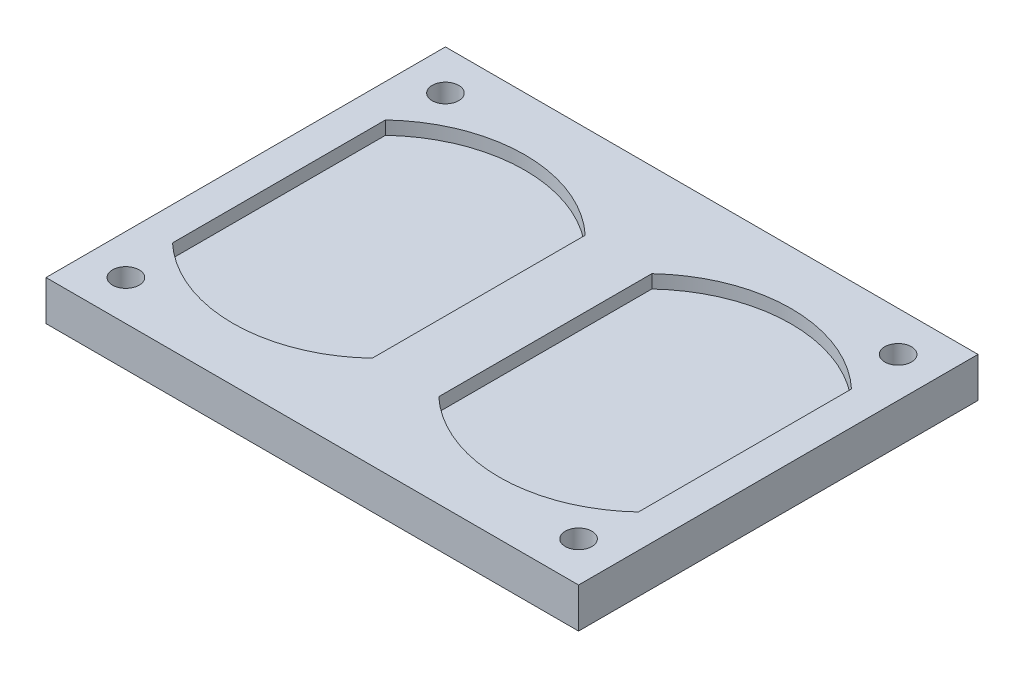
ISO-10303-21;
HEADER;
FILE_DESCRIPTION(('STEP AP214'),'2;1');
FILE_NAME('part.step','',(''),(''),'','','');
FILE_SCHEMA(('AUTOMOTIVE_DESIGN { 1 0 10303 214 1 1 1 1 }'));
ENDSEC;
DATA;
#1=APPLICATION_CONTEXT('core data for automotive mechanical design processes');
#2=APPLICATION_PROTOCOL_DEFINITION('international standard','automotive_design',2000,#1);
#3=PRODUCT_CONTEXT('',#1,'mechanical');
#4=PRODUCT('Part','Part','',(#3));
#5=PRODUCT_RELATED_PRODUCT_CATEGORY('part','',(#4));
#6=PRODUCT_DEFINITION_FORMATION('','',#4);
#7=PRODUCT_DEFINITION_CONTEXT('part definition',#1,'design');
#8=PRODUCT_DEFINITION('design','',#6,#7);
#9=PRODUCT_DEFINITION_SHAPE('','',#8);
#10=(LENGTH_UNIT() NAMED_UNIT(*) SI_UNIT(.MILLI.,.METRE.));
#11=(NAMED_UNIT(*) PLANE_ANGLE_UNIT() SI_UNIT($,.RADIAN.));
#12=(NAMED_UNIT(*) SI_UNIT($,.STERADIAN.) SOLID_ANGLE_UNIT());
#13=UNCERTAINTY_MEASURE_WITH_UNIT(LENGTH_MEASURE(1.E-05),#10,'distance_accuracy_value','');
#14=(GEOMETRIC_REPRESENTATION_CONTEXT(3) GLOBAL_UNCERTAINTY_ASSIGNED_CONTEXT((#13)) GLOBAL_UNIT_ASSIGNED_CONTEXT((#10,
#11,#12)) REPRESENTATION_CONTEXT('',''));
#15=CARTESIAN_POINT('',(0.,0.,0.));
#16=DIRECTION('',(0.,0.,1.));
#17=DIRECTION('',(1.,0.,0.));
#18=AXIS2_PLACEMENT_3D('',#15,#16,#17);
#19=CARTESIAN_POINT('',(0.,0.,0.));
#20=DIRECTION('',(0.,-1.,0.));
#21=DIRECTION('',(0.,0.,-1.));
#22=AXIS2_PLACEMENT_3D('',#19,#20,#21);
#23=PLANE('',#22);
#24=CARTESIAN_POINT('',(-85.,0.,60.));
#25=DIRECTION('',(0.,1.,0.));
#26=DIRECTION('',(0.,0.,1.));
#27=AXIS2_PLACEMENT_3D('',#24,#25,#26);
#28=CIRCLE('',#27,5.);
#29=CARTESIAN_POINT('',(-85.,0.,65.));
#30=VERTEX_POINT('',#29);
#31=EDGE_CURVE('E149',#30,#30,#28,.T.);
#32=ORIENTED_EDGE('',*,*,#31,.T.);
#33=EDGE_LOOP('',(#32));
#34=FACE_BOUND('',#33,.T.);
#35=DIRECTION('',(0.,0.,-1.));
#36=VECTOR('',#35,1.);
#37=CARTESIAN_POINT('',(100.,0.,75.));
#38=LINE('',#37,#36);
#39=CARTESIAN_POINT('',(100.,0.,75.));
#40=VERTEX_POINT('',#39);
#41=CARTESIAN_POINT('',(100.,0.,-75.));
#42=VERTEX_POINT('',#41);
#43=EDGE_CURVE('E162',#40,#42,#38,.T.);
#44=ORIENTED_EDGE('',*,*,#43,.F.);
#45=DIRECTION('',(1.,0.,0.));
#46=VECTOR('',#45,1.);
#47=CARTESIAN_POINT('',(-100.,0.,75.));
#48=LINE('',#47,#46);
#49=CARTESIAN_POINT('',(-100.,0.,75.));
#50=VERTEX_POINT('',#49);
#51=EDGE_CURVE('E199',#50,#40,#48,.T.);
#52=ORIENTED_EDGE('',*,*,#51,.F.);
#53=DIRECTION('',(0.,0.,1.));
#54=VECTOR('',#53,1.);
#55=CARTESIAN_POINT('',(-100.,0.,75.));
#56=LINE('',#55,#54);
#57=CARTESIAN_POINT('',(-100.,0.,-75.));
#58=VERTEX_POINT('',#57);
#59=EDGE_CURVE('E210',#58,#50,#56,.T.);
#60=ORIENTED_EDGE('',*,*,#59,.F.);
#61=DIRECTION('',(-1.,0.,0.));
#62=VECTOR('',#61,1.);
#63=CARTESIAN_POINT('',(-100.,0.,-75.));
#64=LINE('',#63,#62);
#65=EDGE_CURVE('E208',#42,#58,#64,.T.);
#66=ORIENTED_EDGE('',*,*,#65,.F.);
#67=EDGE_LOOP('',(#44,#52,#60,#66));
#68=FACE_BOUND('',#67,.T.);
#69=CARTESIAN_POINT('',(85.,0.,60.));
#70=DIRECTION('',(0.,1.,0.));
#71=DIRECTION('',(0.,0.,1.));
#72=AXIS2_PLACEMENT_3D('',#69,#70,#71);
#73=CIRCLE('',#72,5.);
#74=CARTESIAN_POINT('',(85.,0.,65.));
#75=VERTEX_POINT('',#74);
#76=EDGE_CURVE('E331',#75,#75,#73,.T.);
#77=ORIENTED_EDGE('',*,*,#76,.T.);
#78=EDGE_LOOP('',(#77));
#79=FACE_BOUND('',#78,.T.);
#80=CARTESIAN_POINT('',(85.,0.,-60.));
#81=DIRECTION('',(0.,1.,0.));
#82=DIRECTION('',(0.,0.,1.));
#83=AXIS2_PLACEMENT_3D('',#80,#81,#82);
#84=CIRCLE('',#83,5.);
#85=CARTESIAN_POINT('',(85.,0.,-55.));
#86=VERTEX_POINT('',#85);
#87=EDGE_CURVE('E325',#86,#86,#84,.T.);
#88=ORIENTED_EDGE('',*,*,#87,.T.);
#89=EDGE_LOOP('',(#88));
#90=FACE_BOUND('',#89,.T.);
#91=CARTESIAN_POINT('',(-85.,0.,-60.));
#92=DIRECTION('',(0.,1.,0.));
#93=DIRECTION('',(0.,0.,1.));
#94=AXIS2_PLACEMENT_3D('',#91,#92,#93);
#95=CIRCLE('',#94,5.);
#96=CARTESIAN_POINT('',(-85.,0.,-55.));
#97=VERTEX_POINT('',#96);
#98=EDGE_CURVE('E315',#97,#97,#95,.T.);
#99=ORIENTED_EDGE('',*,*,#98,.T.);
#100=EDGE_LOOP('',(#99));
#101=FACE_BOUND('',#100,.T.);
#102=ADVANCED_FACE('F34',(#34,#68,#79,#90,#101),#23,.T.);
#103=CARTESIAN_POINT('',(0.,15.,0.));
#104=DIRECTION('',(0.,-1.,0.));
#105=DIRECTION('',(0.,0.,-1.));
#106=AXIS2_PLACEMENT_3D('',#103,#104,#105);
#107=PLANE('',#106);
#108=CARTESIAN_POINT('',(-85.,15.,-60.));
#109=DIRECTION('',(0.,1.,0.));
#110=DIRECTION('',(0.,0.,1.));
#111=AXIS2_PLACEMENT_3D('',#108,#109,#110);
#112=CIRCLE('',#111,5.);
#113=CARTESIAN_POINT('',(-85.,15.,-55.));
#114=VERTEX_POINT('',#113);
#115=EDGE_CURVE('E318',#114,#114,#112,.T.);
#116=ORIENTED_EDGE('',*,*,#115,.F.);
#117=EDGE_LOOP('',(#116));
#118=FACE_BOUND('',#117,.T.);
#119=CARTESIAN_POINT('',(85.,15.,-60.));
#120=DIRECTION('',(0.,1.,0.));
#121=DIRECTION('',(0.,0.,1.));
#122=AXIS2_PLACEMENT_3D('',#119,#120,#121);
#123=CIRCLE('',#122,5.);
#124=CARTESIAN_POINT('',(85.,15.,-55.));
#125=VERTEX_POINT('',#124);
#126=EDGE_CURVE('E320',#125,#125,#123,.T.);
#127=ORIENTED_EDGE('',*,*,#126,.F.);
#128=EDGE_LOOP('',(#127));
#129=FACE_BOUND('',#128,.T.);
#130=CARTESIAN_POINT('',(85.,15.,60.));
#131=DIRECTION('',(0.,1.,0.));
#132=DIRECTION('',(0.,0.,1.));
#133=AXIS2_PLACEMENT_3D('',#130,#131,#132);
#134=CIRCLE('',#133,5.);
#135=CARTESIAN_POINT('',(85.,15.,65.));
#136=VERTEX_POINT('',#135);
#137=EDGE_CURVE('E328',#136,#136,#134,.T.);
#138=ORIENTED_EDGE('',*,*,#137,.F.);
#139=EDGE_LOOP('',(#138));
#140=FACE_BOUND('',#139,.T.);
#141=DIRECTION('',(0.,0.,1.));
#142=VECTOR('',#141,1.);
#143=CARTESIAN_POINT('',(-87.5,15.,40.0000000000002));
#144=LINE('',#143,#142);
#145=CARTESIAN_POINT('',(-87.5,15.,-39.9999999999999));
#146=VERTEX_POINT('',#145);
#147=CARTESIAN_POINT('',(-87.4999999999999,15.,40.0000000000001));
#148=VERTEX_POINT('',#147);
#149=EDGE_CURVE('E155',#146,#148,#144,.T.);
#150=ORIENTED_EDGE('',*,*,#149,.F.);
#151=CARTESIAN_POINT('',(-50.,15.,0.));
#152=DIRECTION('',(0.,1.,0.));
#153=DIRECTION('',(0.,0.,-1.));
#154=AXIS2_PLACEMENT_3D('',#151,#152,#153);
#155=CIRCLE('',#154,54.8292804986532);
#156=CARTESIAN_POINT('',(-12.5,15.,-39.9999999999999));
#157=VERTEX_POINT('',#156);
#158=EDGE_CURVE('E49',#157,#146,#155,.T.);
#159=ORIENTED_EDGE('',*,*,#158,.F.);
#160=DIRECTION('',(0.,0.,-1.));
#161=VECTOR('',#160,1.);
#162=CARTESIAN_POINT('',(-12.5,15.,39.9999999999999));
#163=LINE('',#162,#161);
#164=CARTESIAN_POINT('',(-12.5,15.,39.9999999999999));
#165=VERTEX_POINT('',#164);
#166=EDGE_CURVE('E143',#165,#157,#163,.T.);
#167=ORIENTED_EDGE('',*,*,#166,.F.);
#168=CARTESIAN_POINT('',(-50.,15.,0.));
#169=DIRECTION('',(0.,1.,0.));
#170=DIRECTION('',(0.,0.,-1.));
#171=AXIS2_PLACEMENT_3D('',#168,#169,#170);
#172=CIRCLE('',#171,54.8292804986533);
#173=EDGE_CURVE('E146',#148,#165,#172,.T.);
#174=ORIENTED_EDGE('',*,*,#173,.F.);
#175=EDGE_LOOP('',(#150,#159,#167,#174));
#176=FACE_BOUND('',#175,.T.);
#177=DIRECTION('',(0.,0.,-1.));
#178=VECTOR('',#177,1.);
#179=CARTESIAN_POINT('',(87.5000000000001,15.,40.0000000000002));
#180=LINE('',#179,#178);
#181=CARTESIAN_POINT('',(87.5000000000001,15.,40.0000000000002));
#182=VERTEX_POINT('',#181);
#183=CARTESIAN_POINT('',(87.5000000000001,15.,-39.9999999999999));
#184=VERTEX_POINT('',#183);
#185=EDGE_CURVE('E181',#182,#184,#180,.T.);
#186=ORIENTED_EDGE('',*,*,#185,.F.);
#187=CARTESIAN_POINT('',(50.,15.,0.));
#188=DIRECTION('',(0.,1.,0.));
#189=DIRECTION('',(0.,0.,1.));
#190=AXIS2_PLACEMENT_3D('',#187,#188,#189);
#191=CIRCLE('',#190,54.8292804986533);
#192=CARTESIAN_POINT('',(12.5,15.,39.9999999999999));
#193=VERTEX_POINT('',#192);
#194=EDGE_CURVE('E57',#193,#182,#191,.T.);
#195=ORIENTED_EDGE('',*,*,#194,.F.);
#196=DIRECTION('',(0.,0.,1.));
#197=VECTOR('',#196,1.);
#198=CARTESIAN_POINT('',(12.5,15.,39.9999999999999));
#199=LINE('',#198,#197);
#200=CARTESIAN_POINT('',(12.5,15.,-39.9999999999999));
#201=VERTEX_POINT('',#200);
#202=EDGE_CURVE('E170',#201,#193,#199,.T.);
#203=ORIENTED_EDGE('',*,*,#202,.F.);
#204=CARTESIAN_POINT('',(50.,15.,0.));
#205=DIRECTION('',(0.,1.,0.));
#206=DIRECTION('',(0.,0.,1.));
#207=AXIS2_PLACEMENT_3D('',#204,#205,#206);
#208=CIRCLE('',#207,54.8292804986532);
#209=EDGE_CURVE('E184',#184,#201,#208,.T.);
#210=ORIENTED_EDGE('',*,*,#209,.F.);
#211=EDGE_LOOP('',(#186,#195,#203,#210));
#212=FACE_BOUND('',#211,.T.);
#213=DIRECTION('',(0.,0.,-1.));
#214=VECTOR('',#213,1.);
#215=CARTESIAN_POINT('',(100.,15.,75.));
#216=LINE('',#215,#214);
#217=CARTESIAN_POINT('',(100.,15.,75.));
#218=VERTEX_POINT('',#217);
#219=CARTESIAN_POINT('',(100.,15.,-75.));
#220=VERTEX_POINT('',#219);
#221=EDGE_CURVE('E195',#218,#220,#216,.T.);
#222=ORIENTED_EDGE('',*,*,#221,.T.);
#223=DIRECTION('',(-1.,0.,0.));
#224=VECTOR('',#223,1.);
#225=CARTESIAN_POINT('',(-100.,15.,-75.));
#226=LINE('',#225,#224);
#227=CARTESIAN_POINT('',(-100.,15.,-75.));
#228=VERTEX_POINT('',#227);
#229=EDGE_CURVE('E198',#220,#228,#226,.T.);
#230=ORIENTED_EDGE('',*,*,#229,.T.);
#231=DIRECTION('',(0.,0.,1.));
#232=VECTOR('',#231,1.);
#233=CARTESIAN_POINT('',(-100.,15.,75.));
#234=LINE('',#233,#232);
#235=CARTESIAN_POINT('',(-100.,15.,75.));
#236=VERTEX_POINT('',#235);
#237=EDGE_CURVE('E201',#228,#236,#234,.T.);
#238=ORIENTED_EDGE('',*,*,#237,.T.);
#239=DIRECTION('',(1.,0.,0.));
#240=VECTOR('',#239,1.);
#241=CARTESIAN_POINT('',(-100.,15.,75.));
#242=LINE('',#241,#240);
#243=EDGE_CURVE('E203',#236,#218,#242,.T.);
#244=ORIENTED_EDGE('',*,*,#243,.T.);
#245=EDGE_LOOP('',(#222,#230,#238,#244));
#246=FACE_BOUND('',#245,.T.);
#247=CARTESIAN_POINT('',(-85.,15.,60.));
#248=DIRECTION('',(0.,1.,0.));
#249=DIRECTION('',(0.,0.,1.));
#250=AXIS2_PLACEMENT_3D('',#247,#248,#249);
#251=CIRCLE('',#250,5.);
#252=CARTESIAN_POINT('',(-85.,15.,65.));
#253=VERTEX_POINT('',#252);
#254=EDGE_CURVE('E333',#253,#253,#251,.T.);
#255=ORIENTED_EDGE('',*,*,#254,.F.);
#256=EDGE_LOOP('',(#255));
#257=FACE_BOUND('',#256,.T.);
#258=ADVANCED_FACE('F237',(#118,#129,#140,#176,#212,#246,#257),#107,.F.);
#259=CARTESIAN_POINT('',(100.,15.,75.));
#260=DIRECTION('',(-1.,0.,0.));
#261=DIRECTION('',(0.,0.,1.));
#262=AXIS2_PLACEMENT_3D('',#259,#260,#261);
#263=PLANE('',#262);
#264=ORIENTED_EDGE('',*,*,#43,.T.);
#265=DIRECTION('',(0.,-1.,0.));
#266=VECTOR('',#265,1.);
#267=CARTESIAN_POINT('',(100.,15.,-75.));
#268=LINE('',#267,#266);
#269=EDGE_CURVE('E11',#220,#42,#268,.T.);
#270=ORIENTED_EDGE('',*,*,#269,.F.);
#271=ORIENTED_EDGE('',*,*,#221,.F.);
#272=DIRECTION('',(0.,-1.,0.));
#273=VECTOR('',#272,1.);
#274=CARTESIAN_POINT('',(100.,15.,75.));
#275=LINE('',#274,#273);
#276=EDGE_CURVE('E205',#218,#40,#275,.T.);
#277=ORIENTED_EDGE('',*,*,#276,.T.);
#278=EDGE_LOOP('',(#264,#270,#271,#277));
#279=FACE_BOUND('',#278,.T.);
#280=ADVANCED_FACE('F36',(#279),#263,.F.);
#281=CARTESIAN_POINT('',(-100.,15.,-75.));
#282=DIRECTION('',(0.,0.,1.));
#283=DIRECTION('',(1.,0.,0.));
#284=AXIS2_PLACEMENT_3D('',#281,#282,#283);
#285=PLANE('',#284);
#286=ORIENTED_EDGE('',*,*,#65,.T.);
#287=DIRECTION('',(0.,-1.,0.));
#288=VECTOR('',#287,1.);
#289=CARTESIAN_POINT('',(-100.,15.,-75.));
#290=LINE('',#289,#288);
#291=EDGE_CURVE('E42',#228,#58,#290,.T.);
#292=ORIENTED_EDGE('',*,*,#291,.F.);
#293=ORIENTED_EDGE('',*,*,#229,.F.);
#294=ORIENTED_EDGE('',*,*,#269,.T.);
#295=EDGE_LOOP('',(#286,#292,#293,#294));
#296=FACE_BOUND('',#295,.T.);
#297=ADVANCED_FACE('F239',(#296),#285,.F.);
#298=CARTESIAN_POINT('',(-100.,15.,75.));
#299=DIRECTION('',(1.,0.,0.));
#300=DIRECTION('',(0.,0.,-1.));
#301=AXIS2_PLACEMENT_3D('',#298,#299,#300);
#302=PLANE('',#301);
#303=ORIENTED_EDGE('',*,*,#59,.T.);
#304=DIRECTION('',(0.,-1.,0.));
#305=VECTOR('',#304,1.);
#306=CARTESIAN_POINT('',(-100.,15.,75.));
#307=LINE('',#306,#305);
#308=EDGE_CURVE('E215',#236,#50,#307,.T.);
#309=ORIENTED_EDGE('',*,*,#308,.F.);
#310=ORIENTED_EDGE('',*,*,#237,.F.);
#311=ORIENTED_EDGE('',*,*,#291,.T.);
#312=EDGE_LOOP('',(#303,#309,#310,#311));
#313=FACE_BOUND('',#312,.T.);
#314=ADVANCED_FACE('F222',(#313),#302,.F.);
#315=CARTESIAN_POINT('',(-100.,15.,75.));
#316=DIRECTION('',(0.,0.,-1.));
#317=DIRECTION('',(-1.,0.,0.));
#318=AXIS2_PLACEMENT_3D('',#315,#316,#317);
#319=PLANE('',#318);
#320=ORIENTED_EDGE('',*,*,#51,.T.);
#321=ORIENTED_EDGE('',*,*,#276,.F.);
#322=ORIENTED_EDGE('',*,*,#243,.F.);
#323=ORIENTED_EDGE('',*,*,#308,.T.);
#324=EDGE_LOOP('',(#320,#321,#322,#323));
#325=FACE_BOUND('',#324,.T.);
#326=ADVANCED_FACE('F231',(#325),#319,.F.);
#327=CARTESIAN_POINT('',(50.,10.,0.));
#328=DIRECTION('',(0.,1.,0.));
#329=DIRECTION('',(0.,0.,1.));
#330=AXIS2_PLACEMENT_3D('',#327,#328,#329);
#331=CYLINDRICAL_SURFACE('',#330,54.8292804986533);
#332=ORIENTED_EDGE('',*,*,#194,.T.);
#333=DIRECTION('',(0.,1.,0.));
#334=VECTOR('',#333,1.);
#335=CARTESIAN_POINT('',(87.5000000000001,10.,40.0000000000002));
#336=LINE('',#335,#334);
#337=CARTESIAN_POINT('',(87.5000000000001,10.,40.0000000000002));
#338=VERTEX_POINT('',#337);
#339=EDGE_CURVE('E179',#338,#182,#336,.T.);
#340=ORIENTED_EDGE('',*,*,#339,.F.);
#341=CARTESIAN_POINT('',(50.,10.,0.));
#342=DIRECTION('',(0.,1.,0.));
#343=DIRECTION('',(0.,0.,1.));
#344=AXIS2_PLACEMENT_3D('',#341,#342,#343);
#345=CIRCLE('',#344,54.8292804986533);
#346=CARTESIAN_POINT('',(12.5,10.,39.9999999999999));
#347=VERTEX_POINT('',#346);
#348=EDGE_CURVE('E166',#347,#338,#345,.T.);
#349=ORIENTED_EDGE('',*,*,#348,.F.);
#350=DIRECTION('',(0.,1.,0.));
#351=VECTOR('',#350,1.);
#352=CARTESIAN_POINT('',(12.5,10.,39.9999999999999));
#353=LINE('',#352,#351);
#354=EDGE_CURVE('E156',#347,#193,#353,.T.);
#355=ORIENTED_EDGE('',*,*,#354,.T.);
#356=EDGE_LOOP('',(#332,#340,#349,#355));
#357=FACE_BOUND('',#356,.T.);
#358=ADVANCED_FACE('F258',(#357),#331,.F.);
#359=CARTESIAN_POINT('',(12.5,10.,39.9999999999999));
#360=DIRECTION('',(-1.,0.,0.));
#361=DIRECTION('',(0.,0.,1.));
#362=AXIS2_PLACEMENT_3D('',#359,#360,#361);
#363=PLANE('',#362);
#364=ORIENTED_EDGE('',*,*,#202,.T.);
#365=ORIENTED_EDGE('',*,*,#354,.F.);
#366=DIRECTION('',(0.,0.,1.));
#367=VECTOR('',#366,1.);
#368=CARTESIAN_POINT('',(12.5,10.,39.9999999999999));
#369=LINE('',#368,#367);
#370=CARTESIAN_POINT('',(12.5,10.,-39.9999999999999));
#371=VERTEX_POINT('',#370);
#372=EDGE_CURVE('E176',#371,#347,#369,.T.);
#373=ORIENTED_EDGE('',*,*,#372,.F.);
#374=DIRECTION('',(0.,1.,0.));
#375=VECTOR('',#374,1.);
#376=CARTESIAN_POINT('',(12.5,10.,-39.9999999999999));
#377=LINE('',#376,#375);
#378=EDGE_CURVE('E190',#371,#201,#377,.T.);
#379=ORIENTED_EDGE('',*,*,#378,.T.);
#380=EDGE_LOOP('',(#364,#365,#373,#379));
#381=FACE_BOUND('',#380,.T.);
#382=ADVANCED_FACE('F262',(#381),#363,.F.);
#383=CARTESIAN_POINT('',(50.,10.,0.));
#384=DIRECTION('',(0.,1.,0.));
#385=DIRECTION('',(0.,0.,1.));
#386=AXIS2_PLACEMENT_3D('',#383,#384,#385);
#387=CYLINDRICAL_SURFACE('',#386,54.8292804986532);
#388=ORIENTED_EDGE('',*,*,#209,.T.);
#389=ORIENTED_EDGE('',*,*,#378,.F.);
#390=CARTESIAN_POINT('',(50.,10.,0.));
#391=DIRECTION('',(0.,1.,0.));
#392=DIRECTION('',(0.,0.,1.));
#393=AXIS2_PLACEMENT_3D('',#390,#391,#392);
#394=CIRCLE('',#393,54.8292804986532);
#395=CARTESIAN_POINT('',(87.5000000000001,10.,-39.9999999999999));
#396=VERTEX_POINT('',#395);
#397=EDGE_CURVE('E173',#396,#371,#394,.T.);
#398=ORIENTED_EDGE('',*,*,#397,.F.);
#399=DIRECTION('',(0.,1.,0.));
#400=VECTOR('',#399,1.);
#401=CARTESIAN_POINT('',(87.5000000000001,10.,-39.9999999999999));
#402=LINE('',#401,#400);
#403=EDGE_CURVE('E192',#396,#184,#402,.T.);
#404=ORIENTED_EDGE('',*,*,#403,.T.);
#405=EDGE_LOOP('',(#388,#389,#398,#404));
#406=FACE_BOUND('',#405,.T.);
#407=ADVANCED_FACE('F266',(#406),#387,.F.);
#408=CARTESIAN_POINT('',(87.5000000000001,10.,40.0000000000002));
#409=DIRECTION('',(1.,0.,0.));
#410=DIRECTION('',(0.,0.,-1.));
#411=AXIS2_PLACEMENT_3D('',#408,#409,#410);
#412=PLANE('',#411);
#413=ORIENTED_EDGE('',*,*,#185,.T.);
#414=ORIENTED_EDGE('',*,*,#403,.F.);
#415=DIRECTION('',(0.,0.,-1.));
#416=VECTOR('',#415,1.);
#417=CARTESIAN_POINT('',(87.5000000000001,10.,40.0000000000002));
#418=LINE('',#417,#416);
#419=EDGE_CURVE('E169',#338,#396,#418,.T.);
#420=ORIENTED_EDGE('',*,*,#419,.F.);
#421=ORIENTED_EDGE('',*,*,#339,.T.);
#422=EDGE_LOOP('',(#413,#414,#420,#421));
#423=FACE_BOUND('',#422,.T.);
#424=ADVANCED_FACE('F270',(#423),#412,.F.);
#425=CARTESIAN_POINT('',(50.,10.,0.));
#426=DIRECTION('',(0.,1.,0.));
#427=DIRECTION('',(0.,0.,1.));
#428=AXIS2_PLACEMENT_3D('',#425,#426,#427);
#429=PLANE('',#428);
#430=ORIENTED_EDGE('',*,*,#348,.T.);
#431=ORIENTED_EDGE('',*,*,#419,.T.);
#432=ORIENTED_EDGE('',*,*,#397,.T.);
#433=ORIENTED_EDGE('',*,*,#372,.T.);
#434=EDGE_LOOP('',(#430,#431,#432,#433));
#435=FACE_BOUND('',#434,.T.);
#436=ADVANCED_FACE('F273',(#435),#429,.T.);
#437=CARTESIAN_POINT('',(-50.,10.,0.));
#438=DIRECTION('',(0.,1.,0.));
#439=DIRECTION('',(0.,0.,1.));
#440=AXIS2_PLACEMENT_3D('',#437,#438,#439);
#441=CYLINDRICAL_SURFACE('',#440,54.8292804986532);
#442=ORIENTED_EDGE('',*,*,#158,.T.);
#443=DIRECTION('',(0.,1.,0.));
#444=VECTOR('',#443,1.);
#445=CARTESIAN_POINT('',(-87.5,10.,-39.9999999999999));
#446=LINE('',#445,#444);
#447=CARTESIAN_POINT('',(-87.5,10.,-39.9999999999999));
#448=VERTEX_POINT('',#447);
#449=EDGE_CURVE('E121',#448,#146,#446,.T.);
#450=ORIENTED_EDGE('',*,*,#449,.F.);
#451=CARTESIAN_POINT('',(-50.,10.,0.));
#452=DIRECTION('',(0.,1.,0.));
#453=DIRECTION('',(0.,0.,-1.));
#454=AXIS2_PLACEMENT_3D('',#451,#452,#453);
#455=CIRCLE('',#454,54.8292804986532);
#456=CARTESIAN_POINT('',(-12.5,10.,-39.9999999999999));
#457=VERTEX_POINT('',#456);
#458=EDGE_CURVE('E125',#457,#448,#455,.T.);
#459=ORIENTED_EDGE('',*,*,#458,.F.);
#460=DIRECTION('',(0.,1.,0.));
#461=VECTOR('',#460,1.);
#462=CARTESIAN_POINT('',(-12.5,10.,-39.9999999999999));
#463=LINE('',#462,#461);
#464=EDGE_CURVE('E160',#457,#157,#463,.T.);
#465=ORIENTED_EDGE('',*,*,#464,.T.);
#466=EDGE_LOOP('',(#442,#450,#459,#465));
#467=FACE_BOUND('',#466,.T.);
#468=ADVANCED_FACE('F123',(#467),#441,.F.);
#469=CARTESIAN_POINT('',(-12.5,10.,39.9999999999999));
#470=DIRECTION('',(1.,0.,0.));
#471=DIRECTION('',(0.,0.,-1.));
#472=AXIS2_PLACEMENT_3D('',#469,#470,#471);
#473=PLANE('',#472);
#474=ORIENTED_EDGE('',*,*,#166,.T.);
#475=ORIENTED_EDGE('',*,*,#464,.F.);
#476=DIRECTION('',(0.,0.,-1.));
#477=VECTOR('',#476,1.);
#478=CARTESIAN_POINT('',(-12.5,10.,39.9999999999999));
#479=LINE('',#478,#477);
#480=CARTESIAN_POINT('',(-12.5,10.,39.9999999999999));
#481=VERTEX_POINT('',#480);
#482=EDGE_CURVE('E131',#481,#457,#479,.T.);
#483=ORIENTED_EDGE('',*,*,#482,.F.);
#484=DIRECTION('',(0.,1.,0.));
#485=VECTOR('',#484,1.);
#486=CARTESIAN_POINT('',(-12.5,10.,39.9999999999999));
#487=LINE('',#486,#485);
#488=EDGE_CURVE('E163',#481,#165,#487,.T.);
#489=ORIENTED_EDGE('',*,*,#488,.T.);
#490=EDGE_LOOP('',(#474,#475,#483,#489));
#491=FACE_BOUND('',#490,.T.);
#492=ADVANCED_FACE('F283',(#491),#473,.F.);
#493=CARTESIAN_POINT('',(-50.,10.,0.));
#494=DIRECTION('',(0.,1.,0.));
#495=DIRECTION('',(0.,0.,1.));
#496=AXIS2_PLACEMENT_3D('',#493,#494,#495);
#497=CYLINDRICAL_SURFACE('',#496,54.8292804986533);
#498=ORIENTED_EDGE('',*,*,#173,.T.);
#499=ORIENTED_EDGE('',*,*,#488,.F.);
#500=CARTESIAN_POINT('',(-50.,10.,0.));
#501=DIRECTION('',(0.,1.,0.));
#502=DIRECTION('',(0.,0.,-1.));
#503=AXIS2_PLACEMENT_3D('',#500,#501,#502);
#504=CIRCLE('',#503,54.8292804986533);
#505=CARTESIAN_POINT('',(-87.4999999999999,10.,40.0000000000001));
#506=VERTEX_POINT('',#505);
#507=EDGE_CURVE('E139',#506,#481,#504,.T.);
#508=ORIENTED_EDGE('',*,*,#507,.F.);
#509=DIRECTION('',(0.,1.,0.));
#510=VECTOR('',#509,1.);
#511=CARTESIAN_POINT('',(-87.4999999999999,10.,40.0000000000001));
#512=LINE('',#511,#510);
#513=EDGE_CURVE('E130',#506,#148,#512,.T.);
#514=ORIENTED_EDGE('',*,*,#513,.T.);
#515=EDGE_LOOP('',(#498,#499,#508,#514));
#516=FACE_BOUND('',#515,.T.);
#517=ADVANCED_FACE('F286',(#516),#497,.F.);
#518=CARTESIAN_POINT('',(-87.5,10.,40.0000000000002));
#519=DIRECTION('',(-1.,0.,0.));
#520=DIRECTION('',(0.,0.,1.));
#521=AXIS2_PLACEMENT_3D('',#518,#519,#520);
#522=PLANE('',#521);
#523=ORIENTED_EDGE('',*,*,#149,.T.);
#524=ORIENTED_EDGE('',*,*,#513,.F.);
#525=DIRECTION('',(0.,0.,1.));
#526=VECTOR('',#525,1.);
#527=CARTESIAN_POINT('',(-87.5,10.,40.0000000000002));
#528=LINE('',#527,#526);
#529=EDGE_CURVE('E134',#448,#506,#528,.T.);
#530=ORIENTED_EDGE('',*,*,#529,.F.);
#531=ORIENTED_EDGE('',*,*,#449,.T.);
#532=EDGE_LOOP('',(#523,#524,#530,#531));
#533=FACE_BOUND('',#532,.T.);
#534=ADVANCED_FACE('F135',(#533),#522,.F.);
#535=CARTESIAN_POINT('',(-50.,10.,0.));
#536=DIRECTION('',(0.,-1.,0.));
#537=DIRECTION('',(0.,0.,-1.));
#538=AXIS2_PLACEMENT_3D('',#535,#536,#537);
#539=PLANE('',#538);
#540=ORIENTED_EDGE('',*,*,#458,.T.);
#541=ORIENTED_EDGE('',*,*,#529,.T.);
#542=ORIENTED_EDGE('',*,*,#507,.T.);
#543=ORIENTED_EDGE('',*,*,#482,.T.);
#544=EDGE_LOOP('',(#540,#541,#542,#543));
#545=FACE_BOUND('',#544,.T.);
#546=ADVANCED_FACE('F141',(#545),#539,.F.);
#547=CARTESIAN_POINT('',(-85.,15.,60.));
#548=DIRECTION('',(0.,1.,0.));
#549=DIRECTION('',(0.,0.,1.));
#550=AXIS2_PLACEMENT_3D('',#547,#548,#549);
#551=CYLINDRICAL_SURFACE('',#550,5.);
#552=ORIENTED_EDGE('',*,*,#31,.F.);
#553=EDGE_LOOP('',(#552));
#554=FACE_BOUND('',#553,.T.);
#555=ORIENTED_EDGE('',*,*,#254,.T.);
#556=EDGE_LOOP('',(#555));
#557=FACE_BOUND('',#556,.T.);
#558=ADVANCED_FACE('F295',(#554,#557),#551,.F.);
#559=CARTESIAN_POINT('',(85.,15.,60.));
#560=DIRECTION('',(0.,1.,0.));
#561=DIRECTION('',(0.,0.,1.));
#562=AXIS2_PLACEMENT_3D('',#559,#560,#561);
#563=CYLINDRICAL_SURFACE('',#562,5.);
#564=ORIENTED_EDGE('',*,*,#76,.F.);
#565=EDGE_LOOP('',(#564));
#566=FACE_BOUND('',#565,.T.);
#567=ORIENTED_EDGE('',*,*,#137,.T.);
#568=EDGE_LOOP('',(#567));
#569=FACE_BOUND('',#568,.T.);
#570=ADVANCED_FACE('F298',(#566,#569),#563,.F.);
#571=CARTESIAN_POINT('',(85.,15.,-60.));
#572=DIRECTION('',(0.,1.,0.));
#573=DIRECTION('',(0.,0.,1.));
#574=AXIS2_PLACEMENT_3D('',#571,#572,#573);
#575=CYLINDRICAL_SURFACE('',#574,5.);
#576=ORIENTED_EDGE('',*,*,#87,.F.);
#577=EDGE_LOOP('',(#576));
#578=FACE_BOUND('',#577,.T.);
#579=ORIENTED_EDGE('',*,*,#126,.T.);
#580=EDGE_LOOP('',(#579));
#581=FACE_BOUND('',#580,.T.);
#582=ADVANCED_FACE('F302',(#578,#581),#575,.F.);
#583=CARTESIAN_POINT('',(-85.,15.,-60.));
#584=DIRECTION('',(0.,1.,0.));
#585=DIRECTION('',(0.,0.,1.));
#586=AXIS2_PLACEMENT_3D('',#583,#584,#585);
#587=CYLINDRICAL_SURFACE('',#586,5.);
#588=ORIENTED_EDGE('',*,*,#98,.F.);
#589=EDGE_LOOP('',(#588));
#590=FACE_BOUND('',#589,.T.);
#591=ORIENTED_EDGE('',*,*,#115,.T.);
#592=EDGE_LOOP('',(#591));
#593=FACE_BOUND('',#592,.T.);
#594=ADVANCED_FACE('F306',(#590,#593),#587,.F.);
#595=CLOSED_SHELL('',(#102,#258,#280,#297,#314,#326,#358,#382,#407,#424,#436,#468,#492,#517,
#534,#546,#558,#570,#582,#594));
#596=MANIFOLD_SOLID_BREP('B2',#595);
#597=ADVANCED_BREP_SHAPE_REPRESENTATION('',(#18,#596),#14);
#598=SHAPE_DEFINITION_REPRESENTATION(#9,#597);
ENDSEC;
END-ISO-10303-21;
